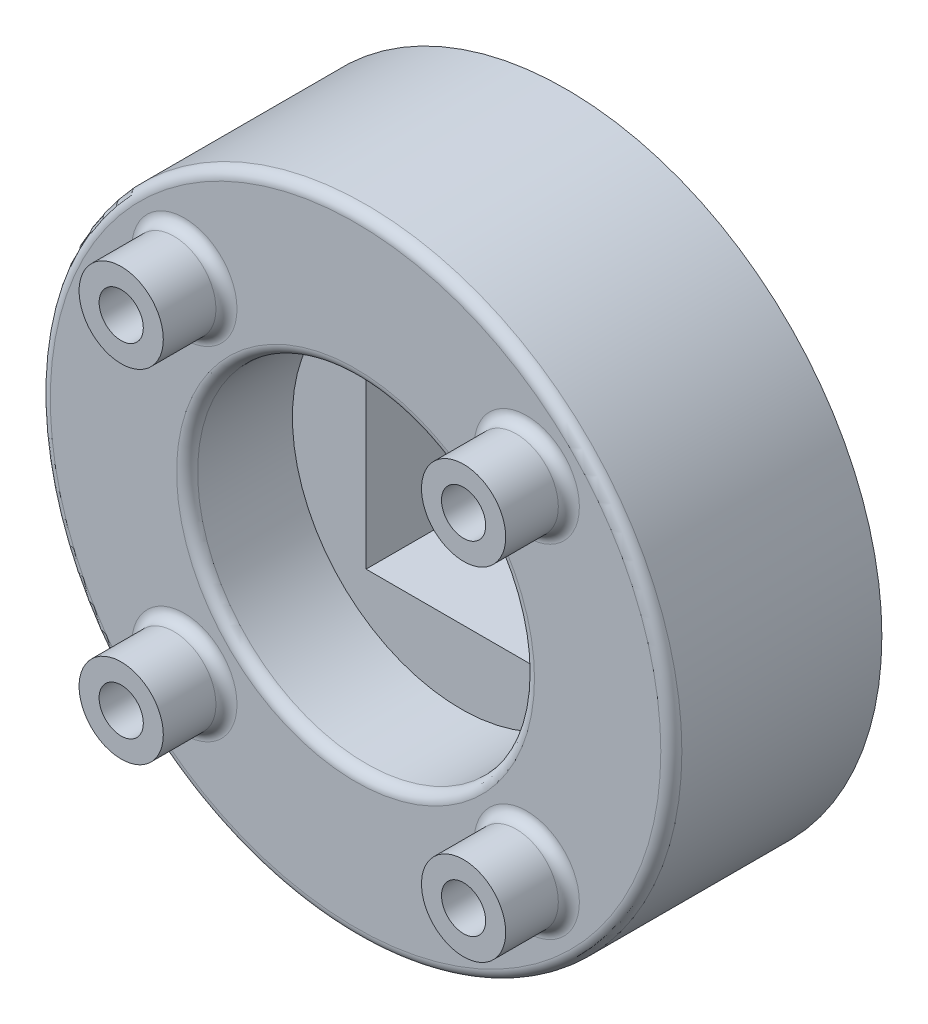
from build123d import *

# Parameters (mm, degrees)
SKETCH1_R                  = 75
BOSS_EXTRUDE1_DEPTH        = 50
SKETCH2_W                  = 45
SKETCH2_H                  = 45
CUT_EXTRUDE3_DEPTH         = 118.260393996
SKETCH3_R                  = 40
CUT_EXTRUDE2_DEPTH         = 25
SKETCH4_R                  = 10
BOSS_EXTRUDE3_DEPTH        = 15
M12X1_5_TAPPED_HOLE1_D     = 10.5
M12X1_5_TAPPED_HOLE1_DEPTH = 31.5
M12X1_5_TAPPED_HOLE1_TIP   = 3.15451825
FILLET1_R                  = 2.5


with BuildPart() as part:
    # Sketch1 → Boss-Extrude1 (new body)
    with BuildSketch(Plane.XY):
        Circle(SKETCH1_R)
    extrude(amount=BOSS_EXTRUDE1_DEPTH)

    # Sketch2 → Cut-Extrude3 (cut, through all)
    with BuildSketch(Plane.XY.offset(50)):
        Rectangle(SKETCH2_W, SKETCH2_H)
    extrude(amount=-CUT_EXTRUDE3_DEPTH, mode=Mode.SUBTRACT)

    # Sketch3 → Cut-Extrude2 (cut)
    with BuildSketch(Plane.XY.offset(50)):
        Circle(SKETCH3_R)
    extrude(amount=-CUT_EXTRUDE2_DEPTH, mode=Mode.SUBTRACT)

    # Sketch4 → Boss-Extrude3 (add)
    with BuildSketch(Plane.XY.offset(50)):
        with Locations((-40.658639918, 40.658639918)):
            Circle(SKETCH4_R)
        with Locations((40.658639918, 40.658639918)):
            Circle(SKETCH4_R)
        with Locations((40.658639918, -40.658639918)):
            Circle(SKETCH4_R)
        with Locations((-40.658639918, -40.658639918)):
            Circle(SKETCH4_R)
    extrude(amount=BOSS_EXTRUDE3_DEPTH)

    # M12x1.5 Tapped Hole1
    with Locations(Plane.XY.offset(65)):
        with Locations((-40.658639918, 40.658639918), (40.658639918, 40.658639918), (40.658639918, -40.658639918), (-40.658639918, -40.658639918)):
            Hole(M12X1_5_TAPPED_HOLE1_D / 2, depth=M12X1_5_TAPPED_HOLE1_DEPTH)
            with Locations((0, 0, -(M12X1_5_TAPPED_HOLE1_DEPTH + M12X1_5_TAPPED_HOLE1_TIP / 2))):  # 118° drill point
                Cone(0, M12X1_5_TAPPED_HOLE1_D / 2, M12X1_5_TAPPED_HOLE1_TIP, mode=Mode.SUBTRACT)

    # Fillet1
    fillet1_edges = [part.edges().sort_by_distance(p)[0] for p in [
        (-40, 0, 50),
        (-50.658639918, 40.658639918, 50),
        (30.658639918, 40.658639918, 50),
        (30.658639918, -40.658639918, 50),
        (-75, 0, 50),
        (-50.658639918, -40.658639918, 50),
    ]]
    fillet(fillet1_edges, radius=FILLET1_R)


solid = part.part
